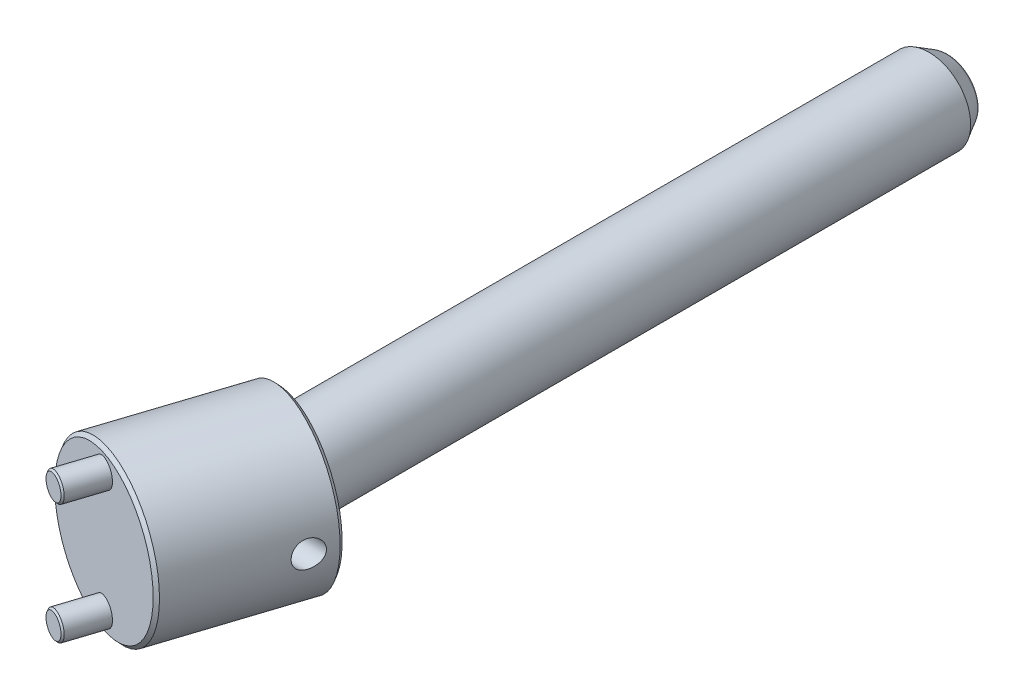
ISO-10303-21;
HEADER;
FILE_DESCRIPTION(('STEP AP214'),'2;1');
FILE_NAME('part.step','',(''),(''),'','','');
FILE_SCHEMA(('AUTOMOTIVE_DESIGN { 1 0 10303 214 1 1 1 1 }'));
ENDSEC;
DATA;
#1=APPLICATION_CONTEXT('core data for automotive mechanical design processes');
#2=APPLICATION_PROTOCOL_DEFINITION('international standard','automotive_design',2000,#1);
#3=PRODUCT_CONTEXT('',#1,'mechanical');
#4=PRODUCT('Part','Part','',(#3));
#5=PRODUCT_RELATED_PRODUCT_CATEGORY('part','',(#4));
#6=PRODUCT_DEFINITION_FORMATION('','',#4);
#7=PRODUCT_DEFINITION_CONTEXT('part definition',#1,'design');
#8=PRODUCT_DEFINITION('design','',#6,#7);
#9=PRODUCT_DEFINITION_SHAPE('','',#8);
#10=(LENGTH_UNIT() NAMED_UNIT(*) SI_UNIT(.MILLI.,.METRE.));
#11=(NAMED_UNIT(*) PLANE_ANGLE_UNIT() SI_UNIT($,.RADIAN.));
#12=(NAMED_UNIT(*) SI_UNIT($,.STERADIAN.) SOLID_ANGLE_UNIT());
#13=UNCERTAINTY_MEASURE_WITH_UNIT(LENGTH_MEASURE(1.E-05),#10,'distance_accuracy_value','');
#14=(GEOMETRIC_REPRESENTATION_CONTEXT(3) GLOBAL_UNCERTAINTY_ASSIGNED_CONTEXT((#13)) GLOBAL_UNIT_ASSIGNED_CONTEXT((#10,
#11,#12)) REPRESENTATION_CONTEXT('',''));
#15=CARTESIAN_POINT('',(0.,0.,0.));
#16=DIRECTION('',(0.,0.,1.));
#17=DIRECTION('',(1.,0.,0.));
#18=AXIS2_PLACEMENT_3D('',#15,#16,#17);
#19=CARTESIAN_POINT('',(-12.8586860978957,0.,55.7553064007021));
#20=DIRECTION('',(-0.309016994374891,0.,0.951056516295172));
#21=DIRECTION('',(-0.951056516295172,0.,-0.309016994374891));
#22=AXIS2_PLACEMENT_3D('',#19,#20,#21);
#23=PLANE('',#22);
#24=CARTESIAN_POINT('',(-12.8586860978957,18.,55.7553064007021));
#25=DIRECTION('',(-0.309016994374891,0.,0.951056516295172));
#26=DIRECTION('',(-0.951056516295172,0.,-0.309016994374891));
#27=AXIS2_PLACEMENT_3D('',#24,#25,#26);
#28=CIRCLE('',#27,3.50000030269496);
#29=CARTESIAN_POINT('',(-16.1873841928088,18.,54.6737468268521));
#30=VERTEX_POINT('',#29);
#31=EDGE_CURVE('P0_E17',#30,#30,#28,.F.);
#32=ORIENTED_EDGE('',*,*,#31,.F.);
#33=EDGE_LOOP('',(#32));
#34=FACE_BOUND('',#33,.T.);
#35=ADVANCED_FACE('P0_F14',(#34),#23,.T.);
#36=CARTESIAN_POINT('',(-12.8586860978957,0.,55.7553064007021));
#37=DIRECTION('',(-0.309016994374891,0.,0.951056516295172));
#38=DIRECTION('',(-0.951056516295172,0.,-0.309016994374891));
#39=AXIS2_PLACEMENT_3D('',#36,#37,#38);
#40=PLANE('',#39);
#41=CARTESIAN_POINT('',(-12.8586860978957,-18.,55.7553064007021));
#42=DIRECTION('',(-0.309016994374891,0.,0.951056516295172));
#43=DIRECTION('',(-0.951056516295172,0.,-0.309016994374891));
#44=AXIS2_PLACEMENT_3D('',#41,#42,#43);
#45=CIRCLE('',#44,3.50000030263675);
#46=CARTESIAN_POINT('',(-16.1873841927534,-18.,54.67374682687));
#47=VERTEX_POINT('',#46);
#48=EDGE_CURVE('P0_E121',#47,#47,#45,.F.);
#49=ORIENTED_EDGE('',*,*,#48,.F.);
#50=EDGE_LOOP('',(#49));
#51=FACE_BOUND('',#50,.T.);
#52=ADVANCED_FACE('P0_F111',(#51),#40,.T.);
#53=CARTESIAN_POINT('',(0.,0.,37.5000000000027));
#54=DIRECTION('',(0.,0.,1.));
#55=DIRECTION('',(-1.,0.,0.));
#56=AXIS2_PLACEMENT_3D('',#53,#54,#55);
#57=PLANE('',#56);
#58=CARTESIAN_POINT('',(-4.60395610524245E-12,0.,37.5000000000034));
#59=DIRECTION('',(0.,0.,1.));
#60=DIRECTION('',(-1.,0.,0.));
#61=AXIS2_PLACEMENT_3D('',#58,#59,#60);
#62=CIRCLE('',#61,12.5);
#63=CARTESIAN_POINT('',(-12.5000000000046,0.,37.5000000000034));
#64=VERTEX_POINT('',#63);
#65=EDGE_CURVE('P0_E36',#64,#64,#62,.F.);
#66=ORIENTED_EDGE('',*,*,#65,.T.);
#67=EDGE_LOOP('',(#66));
#68=FACE_BOUND('',#67,.T.);
#69=ADVANCED_FACE('P0_F108',(#68),#57,.F.);
#70=CARTESIAN_POINT('',(-12.704177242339,18.,55.2797770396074));
#71=DIRECTION('',(0.309016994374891,0.,-0.951056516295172));
#72=DIRECTION('',(0.951056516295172,0.,0.309016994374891));
#73=AXIS2_PLACEMENT_3D('',#70,#71,#72);
#74=CONICAL_SURFACE('',#73,4.00000150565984,0.785398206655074);
#75=CARTESIAN_POINT('',(-12.7041767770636,18.,55.279775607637));
#76=DIRECTION('',(-0.309016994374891,0.,0.951056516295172));
#77=DIRECTION('',(-0.951056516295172,0.,-0.309016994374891));
#78=AXIS2_PLACEMENT_3D('',#75,#76,#77);
#79=CIRCLE('',#78,4.);
#80=CARTESIAN_POINT('',(-16.5084028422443,18.,54.0437076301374));
#81=VERTEX_POINT('',#80);
#82=EDGE_CURVE('P0_E33',#81,#81,#79,.F.);
#83=ORIENTED_EDGE('',*,*,#82,.F.);
#84=EDGE_LOOP('',(#83));
#85=FACE_BOUND('',#84,.T.);
#86=ORIENTED_EDGE('',*,*,#31,.T.);
#87=EDGE_LOOP('',(#86));
#88=FACE_BOUND('',#87,.T.);
#89=ADVANCED_FACE('P0_F104',(#85,#88),#74,.T.);
#90=CARTESIAN_POINT('',(-12.704177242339,-18.,55.2797770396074));
#91=DIRECTION('',(0.309016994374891,0.,-0.951056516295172));
#92=DIRECTION('',(0.951056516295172,0.,0.309016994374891));
#93=AXIS2_PLACEMENT_3D('',#90,#91,#92);
#94=CONICAL_SURFACE('',#93,4.00000150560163,0.785398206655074);
#95=CARTESIAN_POINT('',(-12.7041767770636,-18.,55.279775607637));
#96=DIRECTION('',(-0.309016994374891,0.,0.951056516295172));
#97=DIRECTION('',(-0.951056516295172,0.,-0.309016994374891));
#98=AXIS2_PLACEMENT_3D('',#95,#96,#97);
#99=CIRCLE('',#98,4.);
#100=CARTESIAN_POINT('',(-16.5084028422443,-18.,54.0437076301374));
#101=VERTEX_POINT('',#100);
#102=EDGE_CURVE('P0_E29',#101,#101,#99,.F.);
#103=ORIENTED_EDGE('',*,*,#102,.F.);
#104=EDGE_LOOP('',(#103));
#105=FACE_BOUND('',#104,.T.);
#106=ORIENTED_EDGE('',*,*,#48,.T.);
#107=EDGE_LOOP('',(#106));
#108=FACE_BOUND('',#107,.T.);
#109=ADVANCED_FACE('P0_F99',(#105,#108),#94,.T.);
#110=CARTESIAN_POINT('',(-4.60569082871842E-12,0.,-16.4160236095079));
#111=DIRECTION('',(0.,0.,1.));
#112=DIRECTION('',(-1.,0.,0.));
#113=AXIS2_PLACEMENT_3D('',#110,#111,#112);
#114=CYLINDRICAL_SURFACE('',#113,12.5);
#115=CARTESIAN_POINT('',(-4.60569082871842E-12,0.,2.21350715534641E-12));
#116=DIRECTION('',(0.309016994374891,0.,-0.951056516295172));
#117=DIRECTION('',(0.951056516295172,0.,0.309016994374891));
#118=AXIS2_PLACEMENT_3D('',#115,#116,#117);
#119=ELLIPSE('',#118,13.1432778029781,12.5);
#120=CARTESIAN_POINT('',(12.4999999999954,0.,4.06149620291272));
#121=VERTEX_POINT('',#120);
#122=EDGE_CURVE('P0_E32',#121,#121,#119,.F.);
#123=ORIENTED_EDGE('',*,*,#122,.F.);
#124=EDGE_LOOP('',(#123));
#125=FACE_BOUND('',#124,.T.);
#126=ORIENTED_EDGE('',*,*,#65,.F.);
#127=EDGE_LOOP('',(#126));
#128=FACE_BOUND('',#127,.T.);
#129=CARTESIAN_POINT('',(12.4999999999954,0.,13.0000000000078));
#130=CARTESIAN_POINT('',(12.4999998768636,0.109267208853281,13.0000001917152));
#131=CARTESIAN_POINT('',(12.4985638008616,0.218537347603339,13.0044812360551));
#132=CARTESIAN_POINT('',(12.4928582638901,0.436308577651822,13.0223652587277));
#133=CARTESIAN_POINT('',(12.4885877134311,0.544809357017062,13.035771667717));
#134=CARTESIAN_POINT('',(12.4773197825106,0.760358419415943,13.0714127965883));
#135=CARTESIAN_POINT('',(12.4703188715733,0.867404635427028,13.09365894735));
#136=CARTESIAN_POINT('',(12.4537844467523,1.07914970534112,13.1467710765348));
#137=CARTESIAN_POINT('',(12.4442499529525,1.18384763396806,13.1776403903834));
#138=CARTESIAN_POINT('',(12.4122608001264,1.4927778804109,13.2826442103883));
#139=CARTESIAN_POINT('',(12.3863805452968,1.69256281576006,13.3692944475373));
#140=CARTESIAN_POINT('',(12.3281610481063,2.07458913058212,13.5731871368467));
#141=CARTESIAN_POINT('',(12.2958227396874,2.25683304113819,13.6904251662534));
#142=CARTESIAN_POINT('',(12.226927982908,2.60472253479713,13.9562044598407));
#143=CARTESIAN_POINT('',(12.1902760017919,2.76972880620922,14.1055591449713));
#144=CARTESIAN_POINT('',(12.1174284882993,3.07283077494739,14.4295989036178));
#145=CARTESIAN_POINT('',(12.0812330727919,3.21091970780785,14.604290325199));
#146=CARTESIAN_POINT('',(12.0123702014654,3.45978450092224,14.9796324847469));
#147=CARTESIAN_POINT('',(11.9798194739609,3.56975347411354,15.1808417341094));
#148=CARTESIAN_POINT('',(11.9233663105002,3.75402351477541,15.6001070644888));
#149=CARTESIAN_POINT('',(11.8994614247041,3.82833468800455,15.8181583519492));
#150=CARTESIAN_POINT('',(11.8640030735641,3.93682830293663,16.2577064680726));
#151=CARTESIAN_POINT('',(11.8520853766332,3.97219740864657,16.47888017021));
#152=CARTESIAN_POINT('',(11.8408707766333,4.00551082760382,16.9243189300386));
#153=CARTESIAN_POINT('',(11.8415703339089,4.00346563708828,17.1485831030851));
#154=CARTESIAN_POINT('',(11.8551904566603,3.96293460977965,17.5839134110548));
#155=CARTESIAN_POINT('',(11.8676003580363,3.92597140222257,17.7951400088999));
#156=CARTESIAN_POINT('',(11.9024113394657,3.81912665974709,18.2082211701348));
#157=CARTESIAN_POINT('',(11.9248135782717,3.74924130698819,18.4100746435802));
#158=CARTESIAN_POINT('',(11.9774670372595,3.5774893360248,18.8022499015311));
#159=CARTESIAN_POINT('',(12.0078322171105,3.47515345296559,18.9923501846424));
#160=CARTESIAN_POINT('',(12.0729382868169,3.2417276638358,19.3531656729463));
#161=CARTESIAN_POINT('',(12.1076801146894,3.11063158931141,19.5238767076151));
#162=CARTESIAN_POINT('',(12.179651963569,2.81604951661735,19.849628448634));
#163=CARTESIAN_POINT('',(12.2169216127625,2.65131653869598,20.0035328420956));
#164=CARTESIAN_POINT('',(12.2883204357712,2.29773509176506,20.2819176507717));
#165=CARTESIAN_POINT('',(12.322448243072,2.10887621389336,20.4063852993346));
#166=CARTESIAN_POINT('',(12.3686038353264,1.81051879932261,20.5686214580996));
#167=CARTESIAN_POINT('',(12.3832112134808,1.70799133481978,20.6188153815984));
#168=CARTESIAN_POINT('',(12.4102662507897,1.49879447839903,20.7103404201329));
#169=CARTESIAN_POINT('',(12.4227147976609,1.39212681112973,20.7516751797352));
#170=CARTESIAN_POINT('',(12.4450730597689,1.17558171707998,20.8250571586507));
#171=CARTESIAN_POINT('',(12.4549867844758,1.0657096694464,20.857119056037));
#172=CARTESIAN_POINT('',(12.4720081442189,0.843458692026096,20.911733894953));
#173=CARTESIAN_POINT('',(12.479117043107,0.731080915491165,20.9342911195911));
#174=CARTESIAN_POINT('',(12.4897717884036,0.515800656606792,20.9679498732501));
#175=CARTESIAN_POINT('',(12.49359926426,0.413053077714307,20.9799597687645));
#176=CARTESIAN_POINT('',(12.4987134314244,0.206871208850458,20.9959849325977));
#177=CARTESIAN_POINT('',(12.5000001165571,0.103436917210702,21.0000001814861));
#178=CARTESIAN_POINT('',(12.4999998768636,-0.109267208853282,20.9999998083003));
#179=CARTESIAN_POINT('',(12.4985638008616,-0.21853734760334,20.9955187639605));
#180=CARTESIAN_POINT('',(12.4928582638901,-0.436308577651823,20.9776347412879));
#181=CARTESIAN_POINT('',(12.488587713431,-0.544809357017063,20.9642283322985));
#182=CARTESIAN_POINT('',(12.4773197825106,-0.760358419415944,20.9285872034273));
#183=CARTESIAN_POINT('',(12.4703188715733,-0.86740463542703,20.9063410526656));
#184=CARTESIAN_POINT('',(12.4537844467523,-1.07914970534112,20.8532289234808));
#185=CARTESIAN_POINT('',(12.4442499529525,-1.18384763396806,20.8223596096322));
#186=CARTESIAN_POINT('',(12.4122608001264,-1.4927778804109,20.7173557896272));
#187=CARTESIAN_POINT('',(12.3863805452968,-1.69256281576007,20.6307055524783));
#188=CARTESIAN_POINT('',(12.3281610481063,-2.07458913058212,20.4268128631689));
#189=CARTESIAN_POINT('',(12.2958227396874,-2.25683304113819,20.3095748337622));
#190=CARTESIAN_POINT('',(12.2269279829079,-2.60472253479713,20.0437955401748));
#191=CARTESIAN_POINT('',(12.1902760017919,-2.76972880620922,19.8944408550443));
#192=CARTESIAN_POINT('',(12.1174284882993,-3.07283077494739,19.5704010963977));
#193=CARTESIAN_POINT('',(12.0812330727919,-3.21091970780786,19.3957096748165));
#194=CARTESIAN_POINT('',(12.0123702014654,-3.45978450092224,19.0203675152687));
#195=CARTESIAN_POINT('',(11.9798194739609,-3.56975347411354,18.8191582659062));
#196=CARTESIAN_POINT('',(11.9233663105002,-3.75402351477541,18.3998929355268));
#197=CARTESIAN_POINT('',(11.8994614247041,-3.82833468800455,18.1818416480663));
#198=CARTESIAN_POINT('',(11.8640030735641,-3.93682830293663,17.742293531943));
#199=CARTESIAN_POINT('',(11.8520853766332,-3.97219740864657,17.5211198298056));
#200=CARTESIAN_POINT('',(11.8408707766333,-4.00551082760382,17.075681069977));
#201=CARTESIAN_POINT('',(11.8415703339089,-4.00346563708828,16.8514168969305));
#202=CARTESIAN_POINT('',(11.8551904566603,-3.96293460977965,16.4160865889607));
#203=CARTESIAN_POINT('',(11.8676003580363,-3.92597140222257,16.2048599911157));
#204=CARTESIAN_POINT('',(11.9024113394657,-3.81912665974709,15.7917788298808));
#205=CARTESIAN_POINT('',(11.9248135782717,-3.74924130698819,15.5899253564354));
#206=CARTESIAN_POINT('',(11.9774670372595,-3.5774893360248,15.1977500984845));
#207=CARTESIAN_POINT('',(12.0078322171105,-3.47515345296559,15.0076498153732));
#208=CARTESIAN_POINT('',(12.0729382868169,-3.2417276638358,14.6468343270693));
#209=CARTESIAN_POINT('',(12.1076801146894,-3.11063158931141,14.4761232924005));
#210=CARTESIAN_POINT('',(12.179651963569,-2.81604951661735,14.1503715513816));
#211=CARTESIAN_POINT('',(12.2169216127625,-2.65131653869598,13.99646715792));
#212=CARTESIAN_POINT('',(12.2883204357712,-2.29773509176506,13.7180823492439));
#213=CARTESIAN_POINT('',(12.3224482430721,-2.10887621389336,13.593614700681));
#214=CARTESIAN_POINT('',(12.3686038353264,-1.81051879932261,13.4313785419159));
#215=CARTESIAN_POINT('',(12.3832112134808,-1.70799133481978,13.3811846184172));
#216=CARTESIAN_POINT('',(12.4102662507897,-1.49879447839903,13.2896595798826));
#217=CARTESIAN_POINT('',(12.4227147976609,-1.39212681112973,13.2483248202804));
#218=CARTESIAN_POINT('',(12.4450730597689,-1.17558171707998,13.1749428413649));
#219=CARTESIAN_POINT('',(12.4549867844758,-1.0657096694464,13.1428809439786));
#220=CARTESIAN_POINT('',(12.4720081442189,-0.843458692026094,13.0882661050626));
#221=CARTESIAN_POINT('',(12.479117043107,-0.731080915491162,13.0657088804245));
#222=CARTESIAN_POINT('',(12.4897717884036,-0.51580065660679,13.0320501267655));
#223=CARTESIAN_POINT('',(12.49359926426,-0.413053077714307,13.0200402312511));
#224=CARTESIAN_POINT('',(12.4987134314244,-0.206871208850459,13.0040150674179));
#225=CARTESIAN_POINT('',(12.5000001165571,-0.103436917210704,12.9999998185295));
#226=CARTESIAN_POINT('',(12.4999999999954,0.,13.0000000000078));
#227=B_SPLINE_CURVE_WITH_KNOTS('',3,(#129,#130,#131,#132,#133,#134,#135,#136,#137,#138,#139,
#140,#141,#142,#143,#144,#145,#146,#147,#148,#149,#150,#151,#152,#153,#154,#155,#156,#157,#158,
#159,#160,#161,#162,#163,#164,#165,#166,#167,#168,#169,#170,#171,#172,#173,#174,#175,#176,#177,
#178,#179,#180,#181,#182,#183,#184,#185,#186,#187,#188,#189,#190,#191,#192,#193,#194,#195,#196,
#197,#198,#199,#200,#201,#202,#203,#204,#205,#206,#207,#208,#209,#210,#211,#212,#213,#214,#215,
#216,#217,#218,#219,#220,#221,#222,#223,#224,#225,#226),.UNSPECIFIED.,.T.,.F.,(4,2,2,2,2,2,2,2,
2,2,2,2,2,2,2,2,2,2,2,2,2,2,2,2,2,2,2,2,2,2,2,2,2,2,2,2,2,2,2,2,2,2,2,2,2,2,2,2,4),(0.,
0.327705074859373,0.655536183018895,0.983792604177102,1.31217617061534,1.9667891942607,
2.62130761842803,3.29492000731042,3.9687014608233,4.66006760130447,5.3512376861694,
6.0207071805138,6.6899888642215,7.33137068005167,7.97282689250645,8.62401811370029,
9.27534913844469,9.95775723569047,10.6404607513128,10.9853574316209,11.3301119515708,
11.6743177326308,12.0183682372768,12.3285868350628,12.6388061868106,12.9665112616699,
13.2943423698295,13.6225987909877,13.9509823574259,14.6055953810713,15.2601138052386,
15.933726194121,16.6075076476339,17.298873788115,17.99004387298,18.6595133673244,
19.3287950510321,19.9701768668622,20.611633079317,21.2628243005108,21.9141553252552,
22.596563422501,23.2792669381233,23.6241636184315,23.9689181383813,24.3131239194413,
24.6571744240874,24.9673930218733,25.2776123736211),.UNSPECIFIED.);
#228=CARTESIAN_POINT('',(12.4999999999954,0.,13.0000000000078));
#229=VERTEX_POINT('',#228);
#230=EDGE_CURVE('P0_E84',#229,#229,#227,.T.);
#231=ORIENTED_EDGE('',*,*,#230,.T.);
#232=EDGE_LOOP('',(#231));
#233=FACE_BOUND('',#232,.T.);
#234=ADVANCED_FACE('P0_F93',(#125,#128,#233),#114,.F.);
#235=CARTESIAN_POINT('',(-9.150482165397,18.,44.34262820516));
#236=DIRECTION('',(-0.309016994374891,0.,0.951056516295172));
#237=DIRECTION('',(-0.951056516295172,0.,-0.309016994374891));
#238=AXIS2_PLACEMENT_3D('',#235,#236,#237);
#239=CYLINDRICAL_SURFACE('',#238,4.);
#240=CARTESIAN_POINT('',(-9.150482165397,18.,44.34262820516));
#241=DIRECTION('',(-0.309016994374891,0.,0.951056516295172));
#242=DIRECTION('',(-0.951056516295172,0.,-0.309016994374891));
#243=AXIS2_PLACEMENT_3D('',#240,#241,#242);
#244=CIRCLE('',#243,4.);
#245=CARTESIAN_POINT('',(-12.9547082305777,18.,43.1065602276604));
#246=VERTEX_POINT('',#245);
#247=EDGE_CURVE('P0_E80',#246,#246,#244,.T.);
#248=ORIENTED_EDGE('',*,*,#247,.T.);
#249=EDGE_LOOP('',(#248));
#250=FACE_BOUND('',#249,.T.);
#251=ORIENTED_EDGE('',*,*,#82,.T.);
#252=EDGE_LOOP('',(#251));
#253=FACE_BOUND('',#252,.T.);
#254=ADVANCED_FACE('P0_F98',(#250,#253),#239,.T.);
#255=CARTESIAN_POINT('',(-9.150482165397,-18.,44.34262820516));
#256=DIRECTION('',(-0.309016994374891,0.,0.951056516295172));
#257=DIRECTION('',(-0.951056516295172,0.,-0.309016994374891));
#258=AXIS2_PLACEMENT_3D('',#255,#256,#257);
#259=CYLINDRICAL_SURFACE('',#258,4.);
#260=CARTESIAN_POINT('',(-9.150482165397,-18.,44.34262820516));
#261=DIRECTION('',(-0.309016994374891,0.,0.951056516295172));
#262=DIRECTION('',(-0.951056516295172,0.,-0.309016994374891));
#263=AXIS2_PLACEMENT_3D('',#260,#261,#262);
#264=CIRCLE('',#263,4.);
#265=CARTESIAN_POINT('',(-12.9547082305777,-18.,43.1065602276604));
#266=VERTEX_POINT('',#265);
#267=EDGE_CURVE('P0_E76',#266,#266,#264,.T.);
#268=ORIENTED_EDGE('',*,*,#267,.T.);
#269=EDGE_LOOP('',(#268));
#270=FACE_BOUND('',#269,.T.);
#271=ORIENTED_EDGE('',*,*,#102,.T.);
#272=EDGE_LOOP('',(#271));
#273=FACE_BOUND('',#272,.T.);
#274=ADVANCED_FACE('P0_F178',(#270,#273),#259,.T.);
#275=CARTESIAN_POINT('',(4.75528258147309,0.,1.54508497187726));
#276=DIRECTION('',(0.309016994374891,0.,-0.951056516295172));
#277=DIRECTION('',(0.951056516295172,0.,0.309016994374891));
#278=AXIS2_PLACEMENT_3D('',#275,#276,#277);
#279=PLANE('',#278);
#280=ORIENTED_EDGE('',*,*,#122,.T.);
#281=EDGE_LOOP('',(#280));
#282=FACE_BOUND('',#281,.T.);
#283=CARTESIAN_POINT('',(4.75528253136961,0.,1.54508512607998));
#284=DIRECTION('',(-0.309016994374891,0.,0.951056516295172));
#285=DIRECTION('',(-0.951056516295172,0.,-0.309016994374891));
#286=AXIS2_PLACEMENT_3D('',#283,#284,#285);
#287=CIRCLE('',#286,22.9999993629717);
#288=CARTESIAN_POINT('',(-17.1190167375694,0.,-5.56230554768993));
#289=VERTEX_POINT('',#288);
#290=EDGE_CURVE('P0_E46',#289,#289,#287,.T.);
#291=ORIENTED_EDGE('',*,*,#290,.F.);
#292=EDGE_LOOP('',(#291));
#293=FACE_BOUND('',#292,.T.);
#294=ADVANCED_FACE('P0_F71',(#282,#293),#279,.T.);
#295=CARTESIAN_POINT('',(-7.30480910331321,0.,17.0000000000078));
#296=DIRECTION('',(1.,0.,0.));
#297=DIRECTION('',(0.,0.,1.));
#298=AXIS2_PLACEMENT_3D('',#295,#296,#297);
#299=CYLINDRICAL_SURFACE('',#298,4.);
#300=ORIENTED_EDGE('',*,*,#230,.F.);
#301=EDGE_LOOP('',(#300));
#302=FACE_BOUND('',#301,.T.);
#303=CARTESIAN_POINT('',(23.6690908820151,0.,21.0000000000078));
#304=CARTESIAN_POINT('',(23.6690908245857,0.111085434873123,20.9999995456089));
#305=CARTESIAN_POINT('',(23.6697826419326,0.222182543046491,20.9953689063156));
#306=CARTESIAN_POINT('',(23.6725615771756,0.443632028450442,20.9768761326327));
#307=CARTESIAN_POINT('',(23.6746493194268,0.553984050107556,20.9630098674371));
#308=CARTESIAN_POINT('',(23.6802580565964,0.773282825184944,20.9261195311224));
#309=CARTESIAN_POINT('',(23.6837812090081,0.88222720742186,20.9030816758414));
#310=CARTESIAN_POINT('',(23.6923158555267,1.0978026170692,20.8480138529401));
#311=CARTESIAN_POINT('',(23.697327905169,1.20443276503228,20.8159805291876));
#312=CARTESIAN_POINT('',(23.708904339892,1.41446054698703,20.7432124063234));
#313=CARTESIAN_POINT('',(23.7154669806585,1.51786166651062,20.7024873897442));
#314=CARTESIAN_POINT('',(23.730234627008,1.7208593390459,20.6126124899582));
#315=CARTESIAN_POINT('',(23.7384402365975,1.82045447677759,20.5634595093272));
#316=CARTESIAN_POINT('',(23.75657809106,2.01501547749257,20.4571651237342));
#317=CARTESIAN_POINT('',(23.7665089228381,2.109985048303,20.4000302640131));
#318=CARTESIAN_POINT('',(23.7882019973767,2.2947495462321,20.2781665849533));
#319=CARTESIAN_POINT('',(23.799964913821,2.38454255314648,20.2134349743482));
#320=CARTESIAN_POINT('',(23.8254156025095,2.55831153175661,20.0768904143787));
#321=CARTESIAN_POINT('',(23.8391037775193,2.64228628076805,20.0050759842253));
#322=CARTESIAN_POINT('',(23.8684926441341,2.80385663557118,19.854917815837));
#323=CARTESIAN_POINT('',(23.8841940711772,2.88144989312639,19.7765716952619));
#324=CARTESIAN_POINT('',(23.9176690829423,3.02968736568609,19.6140179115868));
#325=CARTESIAN_POINT('',(23.9354420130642,3.10033376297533,19.5298121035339));
#326=CARTESIAN_POINT('',(23.9731171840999,3.23428350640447,19.3561498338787));
#327=CARTESIAN_POINT('',(23.993020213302,3.29758411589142,19.2666914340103));
#328=CARTESIAN_POINT('',(24.0351242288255,3.41686514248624,19.0825811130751));
#329=CARTESIAN_POINT('',(24.0573406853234,3.47278975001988,18.9878965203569));
#330=CARTESIAN_POINT('',(24.1039387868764,3.57648450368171,18.7946598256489));
#331=CARTESIAN_POINT('',(24.1283212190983,3.62425166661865,18.6961063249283));
#332=CARTESIAN_POINT('',(24.2046516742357,3.75489435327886,18.3958182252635));
#333=CARTESIAN_POINT('',(24.2598227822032,3.82522495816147,18.1892790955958));
#334=CARTESIAN_POINT('',(24.3794633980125,3.93261703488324,17.7641601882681));
#335=CARTESIAN_POINT('',(24.4441418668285,3.96873993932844,17.5454061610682));
#336=CARTESIAN_POINT('',(24.5802350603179,4.00461382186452,17.1069969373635));
#337=CARTESIAN_POINT('',(24.651651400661,4.00435605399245,16.8873415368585));
#338=CARTESIAN_POINT('',(24.8028668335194,3.96749366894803,16.4420426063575));
#339=CARTESIAN_POINT('',(24.8829046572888,3.92912290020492,16.2166269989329));
#340=CARTESIAN_POINT('',(25.04555652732,3.81503606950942,15.7763847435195));
#341=CARTESIAN_POINT('',(25.1281713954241,3.73930797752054,15.5615615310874));
#342=CARTESIAN_POINT('',(25.2965778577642,3.54828412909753,15.1382703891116));
#343=CARTESIAN_POINT('',(25.3823441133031,3.43135355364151,14.9305294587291));
#344=CARTESIAN_POINT('',(25.5493480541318,3.16130301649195,14.5377071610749));
#345=CARTESIAN_POINT('',(25.6305853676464,3.00818008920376,14.3526276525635));
#346=CARTESIAN_POINT('',(25.7453598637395,2.75458604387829,14.0971417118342));
#347=CARTESIAN_POINT('',(25.7823429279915,2.6663532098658,14.0158678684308));
#348=CARTESIAN_POINT('',(25.853509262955,2.48228698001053,13.8611014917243));
#349=CARTESIAN_POINT('',(25.8876938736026,2.38645726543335,13.7876052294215));
#350=CARTESIAN_POINT('',(25.9527003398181,2.18772834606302,13.6491009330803));
#351=CARTESIAN_POINT('',(25.9835210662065,2.08482678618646,13.5840957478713));
#352=CARTESIAN_POINT('',(26.0412101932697,1.87268093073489,13.4633412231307));
#353=CARTESIAN_POINT('',(26.0680791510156,1.76343753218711,13.4075905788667));
#354=CARTESIAN_POINT('',(26.1153648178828,1.54831671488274,13.3100761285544));
#355=CARTESIAN_POINT('',(26.136123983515,1.44285781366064,13.2675543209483));
#356=CARTESIAN_POINT('',(26.1734325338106,1.22804070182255,13.1914708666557));
#357=CARTESIAN_POINT('',(26.1899825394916,1.11868306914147,13.1579078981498));
#358=CARTESIAN_POINT('',(26.2185016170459,0.897238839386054,13.100253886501));
#359=CARTESIAN_POINT('',(26.2304830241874,0.785160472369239,13.076137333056));
#360=CARTESIAN_POINT('',(26.2496670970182,0.55900349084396,13.037594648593));
#361=CARTESIAN_POINT('',(26.2568731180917,0.444926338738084,13.0231617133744));
#362=CARTESIAN_POINT('',(26.2638906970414,0.275464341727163,13.0091153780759));
#363=CARTESIAN_POINT('',(26.2655988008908,0.220444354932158,13.0056986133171));
#364=CARTESIAN_POINT('',(26.2678778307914,0.110285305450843,13.0011406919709));
#365=CARTESIAN_POINT('',(26.2684487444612,0.055146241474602,12.99999956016));
#366=CARTESIAN_POINT('',(26.2684478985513,-0.104291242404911,13.0000008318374));
#367=CARTESIAN_POINT('',(26.2664043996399,-0.208608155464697,13.0040845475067));
#368=CARTESIAN_POINT('',(26.2582653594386,-0.416488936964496,13.0203744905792));
#369=CARTESIAN_POINT('',(26.2521675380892,-0.520052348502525,13.0325852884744));
#370=CARTESIAN_POINT('',(26.2360119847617,-0.725807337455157,13.06502053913));
#371=CARTESIAN_POINT('',(26.2259469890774,-0.827996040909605,13.0852596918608));
#372=CARTESIAN_POINT('',(26.2020391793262,-1.03008364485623,13.1335103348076));
#373=CARTESIAN_POINT('',(26.1881948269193,-1.12998159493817,13.1615249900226));
#374=CARTESIAN_POINT('',(26.1414446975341,-1.42441798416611,13.2565587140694));
#375=CARTESIAN_POINT('',(26.1032433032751,-1.6146622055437,13.3347224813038));
#376=CARTESIAN_POINT('',(26.0150788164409,-1.97861808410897,13.517666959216));
#377=CARTESIAN_POINT('',(25.9651188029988,-2.15233405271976,13.6224407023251));
#378=CARTESIAN_POINT('',(25.8532790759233,-2.48845408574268,13.8611809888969));
#379=CARTESIAN_POINT('',(25.790923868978,-2.64983984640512,13.9963571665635));
#380=CARTESIAN_POINT('',(25.6591691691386,-2.94813337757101,14.2885141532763));
#381=CARTESIAN_POINT('',(25.5897665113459,-3.0850300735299,14.445504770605));
#382=CARTESIAN_POINT('',(25.4399133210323,-3.34413955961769,14.7935946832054));
#383=CARTESIAN_POINT('',(25.3590432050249,-3.46365631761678,14.9865239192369));
#384=CARTESIAN_POINT('',(25.1958395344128,-3.66833710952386,15.3892975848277));
#385=CARTESIAN_POINT('',(25.1135054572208,-3.75348860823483,15.5991481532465));
#386=CARTESIAN_POINT('',(24.9461010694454,-3.89103892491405,16.0426000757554));
#387=CARTESIAN_POINT('',(24.8611263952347,-3.94139839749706,16.2768725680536));
#388=CARTESIAN_POINT('',(24.6963071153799,-3.99951305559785,16.7525990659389));
#389=CARTESIAN_POINT('',(24.6164622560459,-4.00727034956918,16.9940527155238));
#390=CARTESIAN_POINT('',(24.5032033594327,-3.98607743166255,17.3541778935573));
#391=CARTESIAN_POINT('',(24.4667608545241,-3.97373382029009,17.4730772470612));
#392=CARTESIAN_POINT('',(24.3960369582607,-3.93831803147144,17.7099001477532));
#393=CARTESIAN_POINT('',(24.3617546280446,-3.91525055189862,17.8278240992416));
#394=CARTESIAN_POINT('',(24.29555779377,-3.85839046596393,18.0617539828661));
#395=CARTESIAN_POINT('',(24.2636437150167,-3.82459593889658,18.177759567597));
#396=CARTESIAN_POINT('',(24.2023612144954,-3.74641132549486,18.4067808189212));
#397=CARTESIAN_POINT('',(24.1729916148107,-3.70202617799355,18.5197978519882));
#398=CARTESIAN_POINT('',(24.1183456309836,-3.60544483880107,18.7361055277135));
#399=CARTESIAN_POINT('',(24.0929360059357,-3.5537725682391,18.8395967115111));
#400=CARTESIAN_POINT('',(24.0445449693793,-3.44140253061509,19.0420943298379));
#401=CARTESIAN_POINT('',(24.0215624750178,-3.3807088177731,19.1411027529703));
#402=CARTESIAN_POINT('',(23.9780149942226,-3.25064969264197,19.3338368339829));
#403=CARTESIAN_POINT('',(23.9574503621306,-3.18128301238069,19.427561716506));
#404=CARTESIAN_POINT('',(23.9187169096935,-3.03438792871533,19.6088491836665));
#405=CARTESIAN_POINT('',(23.9005470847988,-2.95686297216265,19.696414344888));
#406=CARTESIAN_POINT('',(23.867230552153,-2.79755199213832,19.8611689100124));
#407=CARTESIAN_POINT('',(23.8519900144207,-2.71607395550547,19.9386374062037));
#408=CARTESIAN_POINT('',(23.8235677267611,-2.54671180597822,20.0865668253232));
#409=CARTESIAN_POINT('',(23.8103851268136,-2.45883036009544,20.1570306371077));
#410=CARTESIAN_POINT('',(23.7859689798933,-2.27719181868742,20.2904567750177));
#411=CARTESIAN_POINT('',(23.7747368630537,-2.18343047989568,20.3534135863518));
#412=CARTESIAN_POINT('',(23.7541362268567,-1.99080558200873,20.4712295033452));
#413=CARTESIAN_POINT('',(23.7447669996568,-1.89194397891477,20.5260916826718));
#414=CARTESIAN_POINT('',(23.7279135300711,-1.69133303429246,20.6265392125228));
#415=CARTESIAN_POINT('',(23.7204030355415,-1.58964956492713,20.6722517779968));
#416=CARTESIAN_POINT('',(23.7069981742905,-1.38276891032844,20.7550443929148));
#417=CARTESIAN_POINT('',(23.7011031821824,-1.27757310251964,20.7921277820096));
#418=CARTESIAN_POINT('',(23.6908537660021,-1.06454972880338,20.8573467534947));
#419=CARTESIAN_POINT('',(23.6864969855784,-0.956726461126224,20.8854960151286));
#420=CARTESIAN_POINT('',(23.6792488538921,-0.739101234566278,20.9326986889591));
#421=CARTESIAN_POINT('',(23.6763568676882,-0.629300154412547,20.9517560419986));
#422=CARTESIAN_POINT('',(23.6724741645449,-0.432906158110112,20.9774508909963));
#423=CARTESIAN_POINT('',(23.6712044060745,-0.346551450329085,20.985903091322));
#424=CARTESIAN_POINT('',(23.6695127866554,-0.173466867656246,20.9971778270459));
#425=CARTESIAN_POINT('',(23.6690909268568,-0.0867369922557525,21.0000003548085));
#426=CARTESIAN_POINT('',(23.6690908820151,0.,21.0000000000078));
#427=B_SPLINE_CURVE_WITH_KNOTS('',3,(#303,#304,#305,#306,#307,#308,#309,#310,#311,#312,#313,
#314,#315,#316,#317,#318,#319,#320,#321,#322,#323,#324,#325,#326,#327,#328,#329,#330,#331,#332,
#333,#334,#335,#336,#337,#338,#339,#340,#341,#342,#343,#344,#345,#346,#347,#348,#349,#350,#351,
#352,#353,#354,#355,#356,#357,#358,#359,#360,#361,#362,#363,#364,#365,#366,#367,#368,#369,#370,
#371,#372,#373,#374,#375,#376,#377,#378,#379,#380,#381,#382,#383,#384,#385,#386,#387,#388,#389,
#390,#391,#392,#393,#394,#395,#396,#397,#398,#399,#400,#401,#402,#403,#404,#405,#406,#407,#408,
#409,#410,#411,#412,#413,#414,#415,#416,#417,#418,#419,#420,#421,#422,#423,#424,#425,#426),
.UNSPECIFIED.,.T.,.F.,(4,2,2,2,2,2,2,2,2,2,2,2,2,2,2,2,2,2,2,2,2,2,2,2,2,2,2,2,2,2,2,2,2,2,2,2,
2,2,2,2,2,2,2,2,2,2,2,2,2,2,2,2,2,2,2,2,2,2,2,2,2,4),(0.,0.333178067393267,0.666505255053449,
1.00033530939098,1.33429007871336,1.66787094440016,2.00157467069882,2.33500634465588,
2.6685609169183,3.00218537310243,3.335932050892,3.66957354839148,4.00333894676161,
4.33950026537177,4.67578425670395,5.34771750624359,6.03759397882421,6.72763629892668,
7.45122044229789,8.17503775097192,8.93159540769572,9.68821507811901,10.0643993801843,
10.4404024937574,10.816531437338,11.1926073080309,11.538901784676,11.8851451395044,
12.2304468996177,12.575505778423,12.7409133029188,12.9063226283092,13.2191407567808,
13.5321349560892,13.8457049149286,14.159402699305,14.7838992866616,15.4082325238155,
16.0641817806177,16.7204269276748,17.4400670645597,18.1599694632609,18.919130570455,
19.6782541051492,20.052767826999,20.4271176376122,20.8015345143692,21.1757771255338,
21.5306275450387,21.8853189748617,22.2400623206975,22.5946563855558,22.9346133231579,
23.2744294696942,23.6144937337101,23.9544285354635,24.2892461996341,24.6239340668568,
24.9581069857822,25.292134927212,25.5522844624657,25.8124343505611),.UNSPECIFIED.);
#428=CARTESIAN_POINT('',(23.6690908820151,0.,21.0000000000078));
#429=VERTEX_POINT('',#428);
#430=EDGE_CURVE('P0_E39',#429,#429,#427,.T.);
#431=ORIENTED_EDGE('',*,*,#430,.F.);
#432=EDGE_LOOP('',(#431));
#433=FACE_BOUND('',#432,.T.);
#434=ADVANCED_FACE('P0_F48',(#302,#433),#299,.F.);
#435=CARTESIAN_POINT('',(-9.150482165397,0.,44.34262820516));
#436=DIRECTION('',(0.309016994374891,0.,-0.951056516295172));
#437=DIRECTION('',(0.951056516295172,0.,0.309016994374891));
#438=AXIS2_PLACEMENT_3D('',#435,#436,#437);
#439=PLANE('',#438);
#440=ORIENTED_EDGE('',*,*,#267,.F.);
#441=EDGE_LOOP('',(#440));
#442=FACE_BOUND('',#441,.T.);
#443=ORIENTED_EDGE('',*,*,#247,.F.);
#444=EDGE_LOOP('',(#443));
#445=FACE_BOUND('',#444,.T.);
#446=CARTESIAN_POINT('',(-9.1504821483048,0.,44.3426281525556));
#447=DIRECTION('',(0.309016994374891,0.,-0.951056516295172));
#448=DIRECTION('',(0.951056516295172,0.,0.309016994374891));
#449=AXIS2_PLACEMENT_3D('',#446,#447,#448);
#450=CIRCLE('',#449,22.9999993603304);
#451=CARTESIAN_POINT('',(12.7238171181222,0.,51.4500188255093));
#452=VERTEX_POINT('',#451);
#453=EDGE_CURVE('P0_E26',#452,#452,#450,.T.);
#454=ORIENTED_EDGE('',*,*,#453,.F.);
#455=EDGE_LOOP('',(#454));
#456=FACE_BOUND('',#455,.T.);
#457=ADVANCED_FACE('P0_F63',(#442,#445,#456),#439,.F.);
#458=CARTESIAN_POINT('',(4.44626538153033,0.,2.49614212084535));
#459=DIRECTION('',(-0.309016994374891,0.,0.951056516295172));
#460=DIRECTION('',(-0.951056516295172,0.,-0.309016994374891));
#461=AXIS2_PLACEMENT_3D('',#458,#459,#460);
#462=CONICAL_SURFACE('',#461,23.9999998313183,0.785398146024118);
#463=ORIENTED_EDGE('',*,*,#290,.T.);
#464=EDGE_LOOP('',(#463));
#465=FACE_BOUND('',#464,.T.);
#466=CARTESIAN_POINT('',(4.44626543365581,0.,2.49614196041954));
#467=DIRECTION('',(0.309016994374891,0.,-0.951056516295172));
#468=DIRECTION('',(0.951056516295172,0.,0.309016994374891));
#469=AXIS2_PLACEMENT_3D('',#466,#467,#468);
#470=CIRCLE('',#469,24.);
#471=CARTESIAN_POINT('',(27.2716218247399,0.,9.91254982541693));
#472=VERTEX_POINT('',#471);
#473=EDGE_CURVE('P0_E21',#472,#472,#470,.F.);
#474=ORIENTED_EDGE('',*,*,#473,.F.);
#475=EDGE_LOOP('',(#474));
#476=FACE_BOUND('',#475,.T.);
#477=ADVANCED_FACE('P0_F60',(#465,#476),#462,.T.);
#478=CARTESIAN_POINT('',(-8.84146496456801,0.,43.3915710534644));
#479=DIRECTION('',(0.309016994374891,0.,-0.951056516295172));
#480=DIRECTION('',(0.951056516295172,0.,0.309016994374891));
#481=AXIS2_PLACEMENT_3D('',#478,#479,#480);
#482=CONICAL_SURFACE('',#481,23.9999999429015,0.785398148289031);
#483=CARTESIAN_POINT('',(-8.84146498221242,0.,43.3915711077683));
#484=DIRECTION('',(0.309016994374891,0.,-0.951056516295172));
#485=DIRECTION('',(0.951056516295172,0.,0.309016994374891));
#486=AXIS2_PLACEMENT_3D('',#483,#484,#485);
#487=CIRCLE('',#486,24.);
#488=CARTESIAN_POINT('',(13.9838914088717,0.,50.8079789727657));
#489=VERTEX_POINT('',#488);
#490=EDGE_CURVE('P0_E9',#489,#489,#487,.T.);
#491=ORIENTED_EDGE('',*,*,#490,.F.);
#492=EDGE_LOOP('',(#491));
#493=FACE_BOUND('',#492,.T.);
#494=ORIENTED_EDGE('',*,*,#453,.T.);
#495=EDGE_LOOP('',(#494));
#496=FACE_BOUND('',#495,.T.);
#497=ADVANCED_FACE('P0_F56',(#493,#496),#482,.T.);
#498=CARTESIAN_POINT('',(-9.8457704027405,0.,46.4825053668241));
#499=DIRECTION('',(0.309016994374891,0.,-0.951056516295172));
#500=DIRECTION('',(0.951056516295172,0.,0.309016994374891));
#501=AXIS2_PLACEMENT_3D('',#498,#499,#500);
#502=CYLINDRICAL_SURFACE('',#501,24.);
#503=ORIENTED_EDGE('',*,*,#473,.T.);
#504=EDGE_LOOP('',(#503));
#505=FACE_BOUND('',#504,.T.);
#506=ORIENTED_EDGE('',*,*,#490,.T.);
#507=EDGE_LOOP('',(#506));
#508=FACE_BOUND('',#507,.T.);
#509=ORIENTED_EDGE('',*,*,#430,.T.);
#510=EDGE_LOOP('',(#509));
#511=FACE_BOUND('',#510,.T.);
#512=ADVANCED_FACE('P0_F52',(#505,#508,#511),#502,.T.);
#513=CLOSED_SHELL('',(#35,#52,#69,#89,#109,#234,#254,#274,#294,#434,#457,#477,#497,#512));
#514=MANIFOLD_SOLID_BREP('P0_B1',#513);
#515=CARTESIAN_POINT('',(0.,0.,-200.));
#516=DIRECTION('',(0.,0.,-1.));
#517=DIRECTION('',(0.,1.,0.));
#518=AXIS2_PLACEMENT_3D('',#515,#516,#517);
#519=PLANE('',#518);
#520=CARTESIAN_POINT('',(0.,0.,-200.));
#521=DIRECTION('',(0.,0.,1.));
#522=DIRECTION('',(-1.,0.,0.));
#523=AXIS2_PLACEMENT_3D('',#520,#521,#522);
#524=CIRCLE('',#523,7.881197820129);
#525=CARTESIAN_POINT('',(-7.8811978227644,0.,-200.));
#526=VERTEX_POINT('',#525);
#527=CARTESIAN_POINT('',(7.8811978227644,0.,-200.));
#528=VERTEX_POINT('',#527);
#529=EDGE_CURVE('P1_E38',#526,#528,#524,.T.);
#530=ORIENTED_EDGE('',*,*,#529,.F.);
#531=CARTESIAN_POINT('',(0.,0.,-200.));
#532=DIRECTION('',(0.,0.,1.));
#533=DIRECTION('',(1.,0.,0.));
#534=AXIS2_PLACEMENT_3D('',#531,#532,#533);
#535=CIRCLE('',#534,7.881197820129);
#536=EDGE_CURVE('P1_E42',#528,#526,#535,.T.);
#537=ORIENTED_EDGE('',*,*,#536,.F.);
#538=EDGE_LOOP('',(#530,#537));
#539=FACE_BOUND('',#538,.T.);
#540=ADVANCED_FACE('P1_F17',(#539),#519,.T.);
#541=CARTESIAN_POINT('',(0.,0.,-198.));
#542=DIRECTION('',(0.,0.,-1.));
#543=DIRECTION('',(0.999976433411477,-0.00686532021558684,0.));
#544=AXIS2_PLACEMENT_3D('',#541,#542,#543);
#545=TOROIDAL_SURFACE('',#544,7.881197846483,2.);
#546=ORIENTED_EDGE('',*,*,#529,.T.);
#547=ORIENTED_EDGE('',*,*,#536,.T.);
#548=EDGE_LOOP('',(#546,#547));
#549=FACE_BOUND('',#548,.T.);
#550=CARTESIAN_POINT('',(0.,0.,-199.000000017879));
#551=DIRECTION('',(0.,0.,1.));
#552=DIRECTION('',(1.,0.,0.));
#553=AXIS2_PLACEMENT_3D('',#550,#551,#552);
#554=CIRCLE('',#553,9.61324864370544);
#555=CARTESIAN_POINT('',(9.61324864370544,0.,-199.000000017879));
#556=VERTEX_POINT('',#555);
#557=EDGE_CURVE('P1_E48',#556,#556,#554,.T.);
#558=ORIENTED_EDGE('',*,*,#557,.F.);
#559=EDGE_LOOP('',(#558));
#560=FACE_BOUND('',#559,.T.);
#561=ADVANCED_FACE('P1_F40',(#549,#560),#545,.T.);
#562=CARTESIAN_POINT('',(0.,0.,37.5));
#563=DIRECTION('',(0.,0.,-1.));
#564=DIRECTION('',(0.,1.,0.));
#565=AXIS2_PLACEMENT_3D('',#562,#563,#564);
#566=PLANE('',#565);
#567=CARTESIAN_POINT('',(0.,0.,37.5));
#568=DIRECTION('',(0.,0.,-1.));
#569=DIRECTION('',(0.,1.,0.));
#570=AXIS2_PLACEMENT_3D('',#567,#568,#569);
#571=CIRCLE('',#570,11.4999975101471);
#572=CARTESIAN_POINT('',(0.,11.4999975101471,37.5));
#573=VERTEX_POINT('',#572);
#574=EDGE_CURVE('P1_E85',#573,#573,#571,.T.);
#575=ORIENTED_EDGE('',*,*,#574,.F.);
#576=EDGE_LOOP('',(#575));
#577=FACE_BOUND('',#576,.T.);
#578=ADVANCED_FACE('P1_F76',(#577),#566,.F.);
#579=CARTESIAN_POINT('',(4.30940107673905,0.,17.));
#580=DIRECTION('',(1.,0.,0.));
#581=DIRECTION('',(0.,0.,1.));
#582=AXIS2_PLACEMENT_3D('',#579,#580,#581);
#583=CONICAL_SURFACE('',#582,3.9999999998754,1.04719755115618);
#584=CARTESIAN_POINT('',(1.99999999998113,0.,16.9999999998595));
#585=VERTEX_POINT('',#584);
#586=VERTEX_LOOP('',#585);
#587=FACE_BOUND('',#586,.T.);
#588=CARTESIAN_POINT('',(4.309401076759,0.,17.));
#589=DIRECTION('',(1.,0.,0.));
#590=DIRECTION('',(0.,0.,1.));
#591=AXIS2_PLACEMENT_3D('',#588,#589,#590);
#592=CIRCLE('',#591,4.);
#593=CARTESIAN_POINT('',(4.309401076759,0.,21.));
#594=VERTEX_POINT('',#593);
#595=EDGE_CURVE('P1_E82',#594,#594,#592,.T.);
#596=ORIENTED_EDGE('',*,*,#595,.T.);
#597=EDGE_LOOP('',(#596));
#598=FACE_BOUND('',#597,.T.);
#599=ADVANCED_FACE('P1_F116',(#587,#598),#583,.F.);
#600=CARTESIAN_POINT('',(0.,0.,-193.999999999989));
#601=DIRECTION('',(0.,0.,1.));
#602=DIRECTION('',(0.,-1.,0.));
#603=AXIS2_PLACEMENT_3D('',#600,#601,#602);
#604=CONICAL_SURFACE('',#603,12.4999999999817,0.5235987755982);
#605=CARTESIAN_POINT('',(0.,0.,-194.));
#606=DIRECTION('',(0.,0.,-1.));
#607=DIRECTION('',(0.,1.,0.));
#608=AXIS2_PLACEMENT_3D('',#605,#606,#607);
#609=CIRCLE('',#608,12.5);
#610=CARTESIAN_POINT('',(0.,12.5,-194.));
#611=VERTEX_POINT('',#610);
#612=EDGE_CURVE('P1_E92',#611,#611,#609,.F.);
#613=ORIENTED_EDGE('',*,*,#612,.F.);
#614=EDGE_LOOP('',(#613));
#615=FACE_BOUND('',#614,.T.);
#616=ORIENTED_EDGE('',*,*,#557,.T.);
#617=EDGE_LOOP('',(#616));
#618=FACE_BOUND('',#617,.T.);
#619=ADVANCED_FACE('P1_F108',(#615,#618),#604,.T.);
#620=CARTESIAN_POINT('',(0.,0.,36.4999985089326));
#621=DIRECTION('',(0.,0.,-1.));
#622=DIRECTION('',(0.,1.,0.));
#623=AXIS2_PLACEMENT_3D('',#620,#621,#622);
#624=CONICAL_SURFACE('',#623,12.4999987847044,0.785398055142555);
#625=CARTESIAN_POINT('',(0.,0.,36.499999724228));
#626=DIRECTION('',(0.,0.,-1.));
#627=DIRECTION('',(0.,1.,0.));
#628=AXIS2_PLACEMENT_3D('',#625,#626,#627);
#629=CIRCLE('',#628,12.5);
#630=CARTESIAN_POINT('',(0.,12.5,36.499999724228));
#631=VERTEX_POINT('',#630);
#632=EDGE_CURVE('P1_E28',#631,#631,#629,.T.);
#633=ORIENTED_EDGE('',*,*,#632,.F.);
#634=EDGE_LOOP('',(#633));
#635=FACE_BOUND('',#634,.T.);
#636=ORIENTED_EDGE('',*,*,#574,.T.);
#637=EDGE_LOOP('',(#636));
#638=FACE_BOUND('',#637,.T.);
#639=ADVANCED_FACE('P1_F105',(#635,#638),#624,.T.);
#640=CARTESIAN_POINT('',(1.375,0.,17.));
#641=DIRECTION('',(1.,0.,0.));
#642=DIRECTION('',(0.,0.,1.));
#643=AXIS2_PLACEMENT_3D('',#640,#641,#642);
#644=CYLINDRICAL_SURFACE('',#643,4.);
#645=ORIENTED_EDGE('',*,*,#595,.F.);
#646=EDGE_LOOP('',(#645));
#647=FACE_BOUND('',#646,.T.);
#648=CARTESIAN_POINT('',(12.5,0.,21.));
#649=CARTESIAN_POINT('',(12.4999998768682,0.109267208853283,20.9999998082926));
#650=CARTESIAN_POINT('',(12.4985638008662,0.218537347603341,20.9955187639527));
#651=CARTESIAN_POINT('',(12.4928582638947,0.436308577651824,20.9776347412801));
#652=CARTESIAN_POINT('',(12.4885877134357,0.544809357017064,20.9642283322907));
#653=CARTESIAN_POINT('',(12.4773197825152,0.760358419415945,20.9285872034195));
#654=CARTESIAN_POINT('',(12.4703188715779,0.867404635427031,20.9063410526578));
#655=CARTESIAN_POINT('',(12.4537844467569,1.07914970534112,20.853228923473));
#656=CARTESIAN_POINT('',(12.4442499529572,1.18384763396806,20.8223596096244));
#657=CARTESIAN_POINT('',(12.412260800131,1.49277788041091,20.7173557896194));
#658=CARTESIAN_POINT('',(12.3863805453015,1.69256281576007,20.6307055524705));
#659=CARTESIAN_POINT('',(12.3281610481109,2.07458913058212,20.4268128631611));
#660=CARTESIAN_POINT('',(12.295822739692,2.25683304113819,20.3095748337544));
#661=CARTESIAN_POINT('',(12.2269279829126,2.60472253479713,20.043795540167));
#662=CARTESIAN_POINT('',(12.1902760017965,2.76972880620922,19.8944408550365));
#663=CARTESIAN_POINT('',(12.1174284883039,3.07283077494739,19.5704010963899));
#664=CARTESIAN_POINT('',(12.0812330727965,3.21091970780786,19.3957096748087));
#665=CARTESIAN_POINT('',(12.01237020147,3.45978450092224,19.0203675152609));
#666=CARTESIAN_POINT('',(11.9798194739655,3.56975347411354,18.8191582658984));
#667=CARTESIAN_POINT('',(11.9233663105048,3.75402351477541,18.399892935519));
#668=CARTESIAN_POINT('',(11.8994614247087,3.82833468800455,18.1818416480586));
#669=CARTESIAN_POINT('',(11.8640030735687,3.93682830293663,17.7422935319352));
#670=CARTESIAN_POINT('',(11.8520853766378,3.97219740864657,17.5211198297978));
#671=CARTESIAN_POINT('',(11.8408707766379,4.00551082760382,17.0756810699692));
#672=CARTESIAN_POINT('',(11.8415703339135,4.00346563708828,16.8514168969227));
#673=CARTESIAN_POINT('',(11.8551904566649,3.96293460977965,16.4160865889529));
#674=CARTESIAN_POINT('',(11.8676003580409,3.92597140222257,16.2048599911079));
#675=CARTESIAN_POINT('',(11.9024113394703,3.81912665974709,15.791778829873));
#676=CARTESIAN_POINT('',(11.9248135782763,3.74924130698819,15.5899253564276));
#677=CARTESIAN_POINT('',(11.9774670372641,3.5774893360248,15.1977500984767));
#678=CARTESIAN_POINT('',(12.0078322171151,3.47515345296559,15.0076498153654));
#679=CARTESIAN_POINT('',(12.0729382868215,3.2417276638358,14.6468343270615));
#680=CARTESIAN_POINT('',(12.107680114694,3.11063158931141,14.4761232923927));
#681=CARTESIAN_POINT('',(12.1796519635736,2.81604951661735,14.1503715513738));
#682=CARTESIAN_POINT('',(12.2169216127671,2.65131653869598,13.9964671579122));
#683=CARTESIAN_POINT('',(12.2883204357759,2.29773509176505,13.7180823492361));
#684=CARTESIAN_POINT('',(12.3224482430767,2.10887621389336,13.5936147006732));
#685=CARTESIAN_POINT('',(12.368603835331,1.8105187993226,13.4313785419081));
#686=CARTESIAN_POINT('',(12.3832112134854,1.70799133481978,13.3811846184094));
#687=CARTESIAN_POINT('',(12.4102662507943,1.49879447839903,13.2896595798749));
#688=CARTESIAN_POINT('',(12.4227147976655,1.39212681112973,13.2483248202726));
#689=CARTESIAN_POINT('',(12.4450730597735,1.17558171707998,13.1749428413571));
#690=CARTESIAN_POINT('',(12.4549867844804,1.0657096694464,13.1428809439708));
#691=CARTESIAN_POINT('',(12.4720081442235,0.843458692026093,13.0882661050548));
#692=CARTESIAN_POINT('',(12.4791170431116,0.731080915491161,13.0657088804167));
#693=CARTESIAN_POINT('',(12.4897717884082,0.515800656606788,13.0320501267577));
#694=CARTESIAN_POINT('',(12.4935992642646,0.413053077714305,13.0200402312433));
#695=CARTESIAN_POINT('',(12.498713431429,0.206871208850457,13.0040150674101));
#696=CARTESIAN_POINT('',(12.5000001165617,0.103436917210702,12.9999998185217));
#697=CARTESIAN_POINT('',(12.4999998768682,-0.109267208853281,13.0000001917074));
#698=CARTESIAN_POINT('',(12.4985638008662,-0.218537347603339,13.0044812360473));
#699=CARTESIAN_POINT('',(12.4928582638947,-0.436308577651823,13.0223652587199));
#700=CARTESIAN_POINT('',(12.4885877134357,-0.544809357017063,13.0357716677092));
#701=CARTESIAN_POINT('',(12.4773197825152,-0.760358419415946,13.0714127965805));
#702=CARTESIAN_POINT('',(12.4703188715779,-0.867404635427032,13.0936589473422));
#703=CARTESIAN_POINT('',(12.4537844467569,-1.07914970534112,13.146771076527));
#704=CARTESIAN_POINT('',(12.4442499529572,-1.18384763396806,13.1776403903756));
#705=CARTESIAN_POINT('',(12.412260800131,-1.4927778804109,13.2826442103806));
#706=CARTESIAN_POINT('',(12.3863805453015,-1.69256281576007,13.3692944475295));
#707=CARTESIAN_POINT('',(12.3281610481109,-2.07458913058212,13.5731871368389));
#708=CARTESIAN_POINT('',(12.295822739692,-2.25683304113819,13.6904251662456));
#709=CARTESIAN_POINT('',(12.2269279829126,-2.60472253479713,13.956204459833));
#710=CARTESIAN_POINT('',(12.1902760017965,-2.76972880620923,14.1055591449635));
#711=CARTESIAN_POINT('',(12.1174284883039,-3.0728307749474,14.4295989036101));
#712=CARTESIAN_POINT('',(12.0812330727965,-3.21091970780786,14.6042903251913));
#713=CARTESIAN_POINT('',(12.01237020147,-3.45978450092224,14.9796324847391));
#714=CARTESIAN_POINT('',(11.9798194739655,-3.56975347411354,15.1808417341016));
#715=CARTESIAN_POINT('',(11.9233663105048,-3.75402351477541,15.600107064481));
#716=CARTESIAN_POINT('',(11.8994614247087,-3.82833468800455,15.8181583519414));
#717=CARTESIAN_POINT('',(11.8640030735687,-3.93682830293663,16.2577064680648));
#718=CARTESIAN_POINT('',(11.8520853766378,-3.97219740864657,16.4788801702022));
#719=CARTESIAN_POINT('',(11.8408707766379,-4.00551082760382,16.9243189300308));
#720=CARTESIAN_POINT('',(11.8415703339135,-4.00346563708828,17.1485831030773));
#721=CARTESIAN_POINT('',(11.8551904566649,-3.96293460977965,17.583913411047));
#722=CARTESIAN_POINT('',(11.8676003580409,-3.92597140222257,17.7951400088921));
#723=CARTESIAN_POINT('',(11.9024113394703,-3.81912665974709,18.208221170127));
#724=CARTESIAN_POINT('',(11.9248135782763,-3.74924130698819,18.4100746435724));
#725=CARTESIAN_POINT('',(11.9774670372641,-3.5774893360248,18.8022499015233));
#726=CARTESIAN_POINT('',(12.0078322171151,-3.47515345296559,18.9923501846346));
#727=CARTESIAN_POINT('',(12.0729382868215,-3.2417276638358,19.3531656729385));
#728=CARTESIAN_POINT('',(12.107680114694,-3.11063158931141,19.5238767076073));
#729=CARTESIAN_POINT('',(12.1796519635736,-2.81604951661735,19.8496284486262));
#730=CARTESIAN_POINT('',(12.2169216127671,-2.65131653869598,20.0035328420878));
#731=CARTESIAN_POINT('',(12.2883204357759,-2.29773509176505,20.2819176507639));
#732=CARTESIAN_POINT('',(12.3224482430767,-2.10887621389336,20.4063852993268));
#733=CARTESIAN_POINT('',(12.368603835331,-1.8105187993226,20.5686214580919));
#734=CARTESIAN_POINT('',(12.3832112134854,-1.70799133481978,20.6188153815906));
#735=CARTESIAN_POINT('',(12.4102662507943,-1.49879447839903,20.7103404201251));
#736=CARTESIAN_POINT('',(12.4227147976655,-1.39212681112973,20.7516751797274));
#737=CARTESIAN_POINT('',(12.4450730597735,-1.17558171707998,20.8250571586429));
#738=CARTESIAN_POINT('',(12.4549867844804,-1.0657096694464,20.8571190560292));
#739=CARTESIAN_POINT('',(12.4720081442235,-0.843458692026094,20.9117338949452));
#740=CARTESIAN_POINT('',(12.4791170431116,-0.731080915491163,20.9342911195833));
#741=CARTESIAN_POINT('',(12.4897717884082,-0.515800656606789,20.9679498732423));
#742=CARTESIAN_POINT('',(12.4935992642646,-0.413053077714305,20.9799597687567));
#743=CARTESIAN_POINT('',(12.498713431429,-0.206871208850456,20.9959849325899));
#744=CARTESIAN_POINT('',(12.5000001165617,-0.103436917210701,21.0000001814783));
#745=CARTESIAN_POINT('',(12.5,0.,21.));
#746=B_SPLINE_CURVE_WITH_KNOTS('',3,(#648,#649,#650,#651,#652,#653,#654,#655,#656,#657,#658,
#659,#660,#661,#662,#663,#664,#665,#666,#667,#668,#669,#670,#671,#672,#673,#674,#675,#676,#677,
#678,#679,#680,#681,#682,#683,#684,#685,#686,#687,#688,#689,#690,#691,#692,#693,#694,#695,#696,
#697,#698,#699,#700,#701,#702,#703,#704,#705,#706,#707,#708,#709,#710,#711,#712,#713,#714,#715,
#716,#717,#718,#719,#720,#721,#722,#723,#724,#725,#726,#727,#728,#729,#730,#731,#732,#733,#734,
#735,#736,#737,#738,#739,#740,#741,#742,#743,#744,#745),.UNSPECIFIED.,.T.,.F.,(4,2,2,2,2,2,2,2,
2,2,2,2,2,2,2,2,2,2,2,2,2,2,2,2,2,2,2,2,2,2,2,2,2,2,2,2,2,2,2,2,2,2,2,2,2,2,2,2,4),(0.,
0.327705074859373,0.655536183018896,0.983792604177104,1.31217617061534,1.96678919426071,
2.62130761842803,3.29492000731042,3.96870146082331,4.66006760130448,5.35123768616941,
6.0207071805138,6.68998886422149,7.33137068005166,7.97282689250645,8.62401811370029,
9.27534913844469,9.95775723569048,10.6404607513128,10.9853574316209,11.3301119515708,
11.6743177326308,12.0183682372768,12.3285868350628,12.6388061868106,12.9665112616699,
13.2943423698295,13.6225987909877,13.9509823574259,14.6055953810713,15.2601138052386,
15.933726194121,16.6075076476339,17.298873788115,17.99004387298,18.6595133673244,
19.3287950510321,19.9701768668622,20.611633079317,21.2628243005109,21.9141553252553,
22.596563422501,23.2792669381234,23.6241636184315,23.9689181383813,24.3131239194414,
24.6571744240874,24.9673930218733,25.2776123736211),.UNSPECIFIED.);
#747=CARTESIAN_POINT('',(12.5,0.,21.));
#748=VERTEX_POINT('',#747);
#749=EDGE_CURVE('P1_E11',#748,#748,#746,.T.);
#750=ORIENTED_EDGE('',*,*,#749,.F.);
#751=EDGE_LOOP('',(#750));
#752=FACE_BOUND('',#751,.T.);
#753=ADVANCED_FACE('P1_F107',(#647,#752),#644,.F.);
#754=CARTESIAN_POINT('',(0.,0.,49.375));
#755=DIRECTION('',(0.,0.,-1.));
#756=DIRECTION('',(0.,1.,0.));
#757=AXIS2_PLACEMENT_3D('',#754,#755,#756);
#758=CYLINDRICAL_SURFACE('',#757,12.5);
#759=ORIENTED_EDGE('',*,*,#612,.T.);
#760=EDGE_LOOP('',(#759));
#761=FACE_BOUND('',#760,.T.);
#762=ORIENTED_EDGE('',*,*,#632,.T.);
#763=EDGE_LOOP('',(#762));
#764=FACE_BOUND('',#763,.T.);
#765=ORIENTED_EDGE('',*,*,#749,.T.);
#766=EDGE_LOOP('',(#765));
#767=FACE_BOUND('',#766,.T.);
#768=ADVANCED_FACE('P1_F102',(#761,#764,#767),#758,.T.);
#769=CLOSED_SHELL('',(#540,#561,#578,#599,#619,#639,#753,#768));
#770=MANIFOLD_SOLID_BREP('P1_B1',#769);
#771=ADVANCED_BREP_SHAPE_REPRESENTATION('',(#18,#514,#770),#14);
#772=SHAPE_DEFINITION_REPRESENTATION(#9,#771);
ENDSEC;
END-ISO-10303-21;
